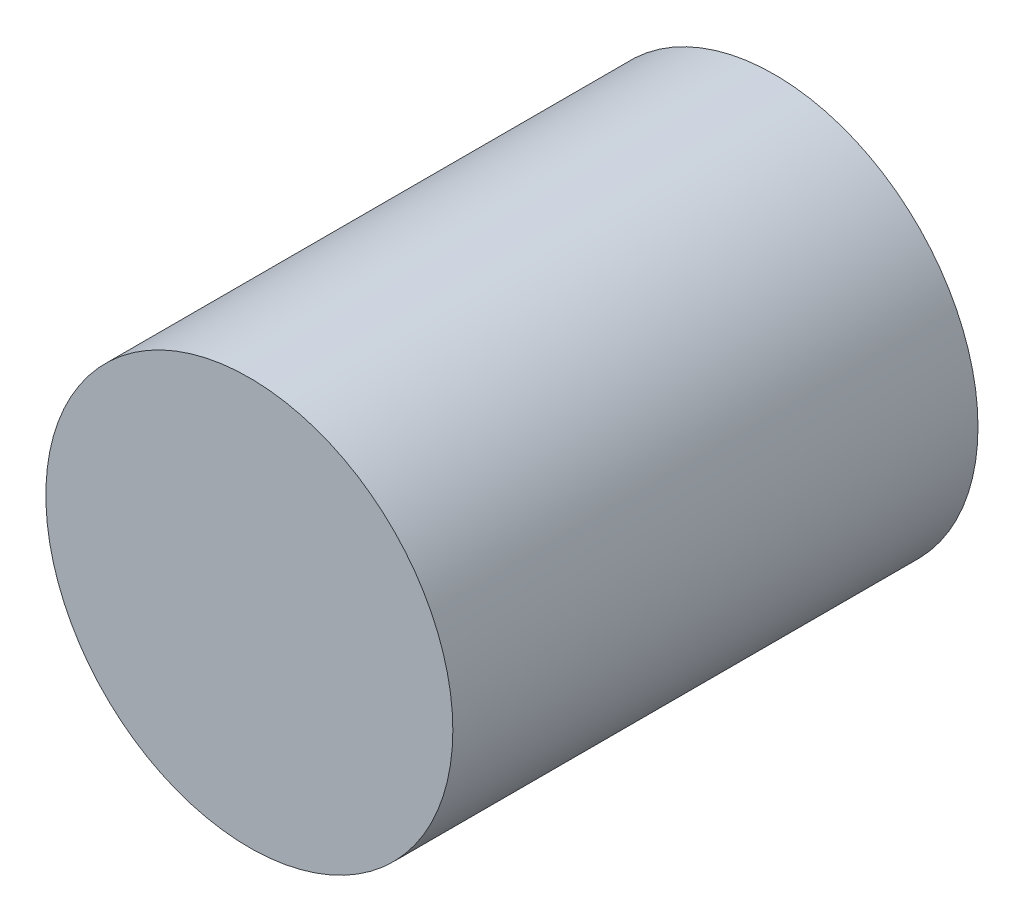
from build123d import *

# Parameters (mm, degrees)
ESQUISSE1_R          = 7.75
BASE_EXTRUSION_DEPTH = 10


with BuildPart() as part:
    # Esquisse1 → Base-Extrusion (new, symmetric)
    with BuildSketch(Plane.XY):
        Circle(ESQUISSE1_R)
    extrude(amount=BASE_EXTRUSION_DEPTH, both=True)


solid = part.part
